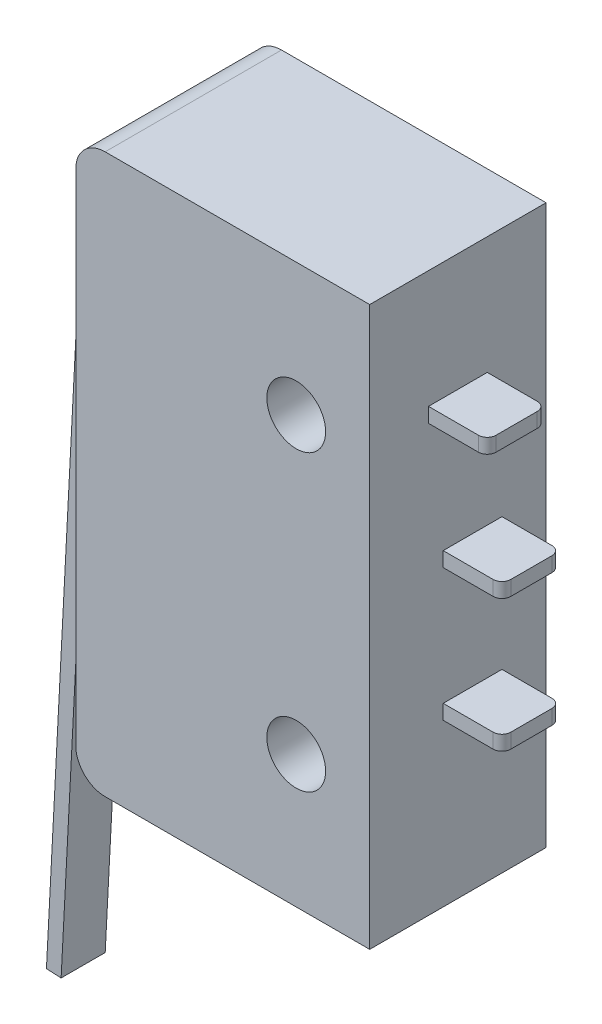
ISO-10303-21;
HEADER;
FILE_DESCRIPTION(('STEP AP214'),'2;1');
FILE_NAME('part.step','',(''),(''),'','','');
FILE_SCHEMA(('AUTOMOTIVE_DESIGN { 1 0 10303 214 1 1 1 1 }'));
ENDSEC;
DATA;
#1=APPLICATION_CONTEXT('core data for automotive mechanical design processes');
#2=APPLICATION_PROTOCOL_DEFINITION('international standard','automotive_design',2000,#1);
#3=PRODUCT_CONTEXT('',#1,'mechanical');
#4=PRODUCT('Part','Part','',(#3));
#5=PRODUCT_RELATED_PRODUCT_CATEGORY('part','',(#4));
#6=PRODUCT_DEFINITION_FORMATION('','',#4);
#7=PRODUCT_DEFINITION_CONTEXT('part definition',#1,'design');
#8=PRODUCT_DEFINITION('design','',#6,#7);
#9=PRODUCT_DEFINITION_SHAPE('','',#8);
#10=(LENGTH_UNIT() NAMED_UNIT(*) SI_UNIT(.MILLI.,.METRE.));
#11=(NAMED_UNIT(*) PLANE_ANGLE_UNIT() SI_UNIT($,.RADIAN.));
#12=(NAMED_UNIT(*) SI_UNIT($,.STERADIAN.) SOLID_ANGLE_UNIT());
#13=UNCERTAINTY_MEASURE_WITH_UNIT(LENGTH_MEASURE(1.E-05),#10,'distance_accuracy_value','');
#14=(GEOMETRIC_REPRESENTATION_CONTEXT(3) GLOBAL_UNCERTAINTY_ASSIGNED_CONTEXT((#13)) GLOBAL_UNIT_ASSIGNED_CONTEXT((#10,
#11,#12)) REPRESENTATION_CONTEXT('',''));
#15=CARTESIAN_POINT('',(0.,0.,0.));
#16=DIRECTION('',(0.,0.,1.));
#17=DIRECTION('',(1.,0.,0.));
#18=AXIS2_PLACEMENT_3D('',#15,#16,#17);
#19=CARTESIAN_POINT('',(-1.93975554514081,16.6495326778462,2.25));
#20=DIRECTION('',(-0.998629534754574,0.0523359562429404,0.));
#21=DIRECTION('',(0.,0.,1.));
#22=AXIS2_PLACEMENT_3D('',#19,#20,#21);
#23=PLANE('',#22);
#24=DIRECTION('',(0.0523359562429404,0.998629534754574,0.));
#25=VECTOR('',#24,1.);
#26=CARTESIAN_POINT('',(-1.93975554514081,16.6495326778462,3.75));
#27=LINE('',#26,#25);
#28=CARTESIAN_POINT('',(-3.24815445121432,-8.3162056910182,3.74999999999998));
#29=VERTEX_POINT('',#28);
#30=CARTESIAN_POINT('',(-2.06141570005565,14.3281186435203,3.75));
#31=VERTEX_POINT('',#30);
#32=EDGE_CURVE('E46',#29,#31,#27,.T.);
#33=ORIENTED_EDGE('',*,*,#32,.T.);
#34=DIRECTION('',(0.,0.,-1.));
#35=VECTOR('',#34,1.);
#36=CARTESIAN_POINT('',(-2.06141569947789,14.32811864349,2.25));
#37=LINE('',#36,#35);
#38=CARTESIAN_POINT('',(-2.06141569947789,14.32811864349,2.25));
#39=VERTEX_POINT('',#38);
#40=EDGE_CURVE('E119',#31,#39,#37,.T.);
#41=ORIENTED_EDGE('',*,*,#40,.T.);
#42=DIRECTION('',(-0.0523359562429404,-0.998629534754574,0.));
#43=VECTOR('',#42,1.);
#44=CARTESIAN_POINT('',(-1.93975554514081,16.6495326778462,2.25));
#45=LINE('',#44,#43);
#46=CARTESIAN_POINT('',(-3.24815445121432,-8.3162056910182,2.24999999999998));
#47=VERTEX_POINT('',#46);
#48=EDGE_CURVE('E138',#39,#47,#45,.T.);
#49=ORIENTED_EDGE('',*,*,#48,.T.);
#50=DIRECTION('',(0.,0.,1.));
#51=VECTOR('',#50,1.);
#52=CARTESIAN_POINT('',(-3.24815445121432,-8.3162056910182,3.74999999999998));
#53=LINE('',#52,#51);
#54=EDGE_CURVE('E66',#47,#29,#53,.T.);
#55=ORIENTED_EDGE('',*,*,#54,.T.);
#56=EDGE_LOOP('',(#33,#41,#49,#55));
#57=FACE_BOUND('',#56,.T.);
#58=ADVANCED_FACE('F42',(#57),#23,.T.);
#59=CARTESIAN_POINT('',(-1.93975554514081,16.6495326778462,2.25));
#60=DIRECTION('',(0.,0.,1.));
#61=DIRECTION('',(0.0523359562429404,0.998629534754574,0.));
#62=AXIS2_PLACEMENT_3D('',#59,#60,#61);
#63=PLANE('',#62);
#64=DIRECTION('',(-0.998629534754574,0.0523359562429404,0.));
#65=VECTOR('',#64,1.);
#66=CARTESIAN_POINT('',(-2.06141569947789,14.32811864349,2.25));
#67=LINE('',#66,#65);
#68=CARTESIAN_POINT('',(-1.56210093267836,14.3019506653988,2.25));
#69=VERTEX_POINT('',#68);
#70=EDGE_CURVE('E13',#69,#39,#67,.T.);
#71=ORIENTED_EDGE('',*,*,#70,.F.);
#72=DIRECTION('',(-0.0523359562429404,-0.998629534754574,0.));
#73=VECTOR('',#72,1.);
#74=CARTESIAN_POINT('',(-1.44044077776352,16.6233646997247,2.25));
#75=LINE('',#74,#73);
#76=CARTESIAN_POINT('',(-2.74883968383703,-8.34237366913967,2.24999999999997));
#77=VERTEX_POINT('',#76);
#78=EDGE_CURVE('E143',#69,#77,#75,.T.);
#79=ORIENTED_EDGE('',*,*,#78,.T.);
#80=DIRECTION('',(0.998629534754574,-0.0523359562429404,0.));
#81=VECTOR('',#80,1.);
#82=CARTESIAN_POINT('',(-3.24815445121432,-8.3162056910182,2.24999999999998));
#83=LINE('',#82,#81);
#84=EDGE_CURVE('E157',#47,#77,#83,.T.);
#85=ORIENTED_EDGE('',*,*,#84,.F.);
#86=ORIENTED_EDGE('',*,*,#48,.F.);
#87=EDGE_LOOP('',(#71,#79,#85,#86));
#88=FACE_BOUND('',#87,.T.);
#89=ADVANCED_FACE('F44',(#88),#63,.F.);
#90=CARTESIAN_POINT('',(-3.24815445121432,-8.3162056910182,3.74999999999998));
#91=DIRECTION('',(0.0523359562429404,0.998629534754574,0.));
#92=DIRECTION('',(0.,0.,-1.));
#93=AXIS2_PLACEMENT_3D('',#90,#91,#92);
#94=PLANE('',#93);
#95=DIRECTION('',(0.,0.,1.));
#96=VECTOR('',#95,1.);
#97=CARTESIAN_POINT('',(-2.74883968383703,-8.34237366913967,3.74999999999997));
#98=LINE('',#97,#96);
#99=CARTESIAN_POINT('',(-2.74883968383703,-8.34237366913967,3.74999999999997));
#100=VERTEX_POINT('',#99);
#101=EDGE_CURVE('E139',#77,#100,#98,.T.);
#102=ORIENTED_EDGE('',*,*,#101,.T.);
#103=DIRECTION('',(0.998629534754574,-0.0523359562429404,0.));
#104=VECTOR('',#103,1.);
#105=CARTESIAN_POINT('',(-3.24815445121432,-8.3162056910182,3.74999999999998));
#106=LINE('',#105,#104);
#107=EDGE_CURVE('E135',#29,#100,#106,.T.);
#108=ORIENTED_EDGE('',*,*,#107,.F.);
#109=ORIENTED_EDGE('',*,*,#54,.F.);
#110=ORIENTED_EDGE('',*,*,#84,.T.);
#111=EDGE_LOOP('',(#102,#108,#109,#110));
#112=FACE_BOUND('',#111,.T.);
#113=ADVANCED_FACE('F161',(#112),#94,.F.);
#114=CARTESIAN_POINT('',(-1.93975554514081,16.6495326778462,3.75));
#115=DIRECTION('',(0.,0.,-1.));
#116=DIRECTION('',(-0.0523359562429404,-0.998629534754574,0.));
#117=AXIS2_PLACEMENT_3D('',#114,#115,#116);
#118=PLANE('',#117);
#119=DIRECTION('',(0.998629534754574,-0.0523359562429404,0.));
#120=VECTOR('',#119,1.);
#121=CARTESIAN_POINT('',(-2.06141569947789,14.32811864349,3.75));
#122=LINE('',#121,#120);
#123=CARTESIAN_POINT('',(-1.56210093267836,14.3019506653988,3.75));
#124=VERTEX_POINT('',#123);
#125=EDGE_CURVE('E109',#31,#124,#122,.T.);
#126=ORIENTED_EDGE('',*,*,#125,.F.);
#127=ORIENTED_EDGE('',*,*,#32,.F.);
#128=ORIENTED_EDGE('',*,*,#107,.T.);
#129=DIRECTION('',(0.0523359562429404,0.998629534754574,0.));
#130=VECTOR('',#129,1.);
#131=CARTESIAN_POINT('',(-1.44044077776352,16.6233646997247,3.75));
#132=LINE('',#131,#130);
#133=EDGE_CURVE('E133',#100,#124,#132,.T.);
#134=ORIENTED_EDGE('',*,*,#133,.T.);
#135=EDGE_LOOP('',(#126,#127,#128,#134));
#136=FACE_BOUND('',#135,.T.);
#137=ADVANCED_FACE('F134',(#136),#118,.F.);
#138=CARTESIAN_POINT('',(-1.44044077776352,16.6233646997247,2.25));
#139=DIRECTION('',(-0.998629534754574,0.0523359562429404,0.));
#140=DIRECTION('',(0.,0.,1.));
#141=AXIS2_PLACEMENT_3D('',#138,#139,#140);
#142=PLANE('',#141);
#143=DIRECTION('',(0.,0.,-1.));
#144=VECTOR('',#143,1.);
#145=CARTESIAN_POINT('',(-1.5621009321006,14.3019506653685,2.25));
#146=LINE('',#145,#144);
#147=EDGE_CURVE('E51',#124,#69,#146,.T.);
#148=ORIENTED_EDGE('',*,*,#147,.F.);
#149=ORIENTED_EDGE('',*,*,#133,.F.);
#150=ORIENTED_EDGE('',*,*,#101,.F.);
#151=ORIENTED_EDGE('',*,*,#78,.F.);
#152=EDGE_LOOP('',(#148,#149,#150,#151));
#153=FACE_BOUND('',#152,.T.);
#154=ADVANCED_FACE('F142',(#153),#142,.F.);
#155=CARTESIAN_POINT('',(0.,15.5,3.75));
#156=DIRECTION('',(-1.,0.,0.));
#157=DIRECTION('',(0.,0.,1.));
#158=AXIS2_PLACEMENT_3D('',#155,#156,#157);
#159=PLANE('',#158);
#160=DIRECTION('',(0.,0.,-1.));
#161=VECTOR('',#160,1.);
#162=CARTESIAN_POINT('',(0.,15.,3.75));
#163=LINE('',#162,#161);
#164=CARTESIAN_POINT('',(0.,15.,3.75));
#165=VERTEX_POINT('',#164);
#166=CARTESIAN_POINT('',(0.,15.,2.25));
#167=VERTEX_POINT('',#166);
#168=EDGE_CURVE('E233',#165,#167,#163,.T.);
#169=ORIENTED_EDGE('',*,*,#168,.T.);
#170=DIRECTION('',(0.,-1.,0.));
#171=VECTOR('',#170,1.);
#172=CARTESIAN_POINT('',(0.,15.5,2.25));
#173=LINE('',#172,#171);
#174=CARTESIAN_POINT('',(0.,15.5,2.25));
#175=VERTEX_POINT('',#174);
#176=EDGE_CURVE('E148',#175,#167,#173,.T.);
#177=ORIENTED_EDGE('',*,*,#176,.F.);
#178=DIRECTION('',(0.,0.,-1.));
#179=VECTOR('',#178,1.);
#180=CARTESIAN_POINT('',(0.,15.5,3.75));
#181=LINE('',#180,#179);
#182=CARTESIAN_POINT('',(0.,15.5,3.75));
#183=VERTEX_POINT('',#182);
#184=EDGE_CURVE('E225',#183,#175,#181,.T.);
#185=ORIENTED_EDGE('',*,*,#184,.F.);
#186=DIRECTION('',(0.,-1.,0.));
#187=VECTOR('',#186,1.);
#188=CARTESIAN_POINT('',(0.,15.5,3.75));
#189=LINE('',#188,#187);
#190=EDGE_CURVE('E230',#183,#165,#189,.T.);
#191=ORIENTED_EDGE('',*,*,#190,.T.);
#192=EDGE_LOOP('',(#169,#177,#185,#191));
#193=FACE_BOUND('',#192,.T.);
#194=ADVANCED_FACE('F175',(#193),#159,.F.);
#195=CARTESIAN_POINT('',(0.,15.5,2.25));
#196=DIRECTION('',(0.,1.,0.));
#197=DIRECTION('',(0.,0.,1.));
#198=AXIS2_PLACEMENT_3D('',#195,#196,#197);
#199=PLANE('',#198);
#200=DIRECTION('',(0.,0.,-1.));
#201=VECTOR('',#200,1.);
#202=CARTESIAN_POINT('',(-0.826510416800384,15.5,2.25));
#203=LINE('',#202,#201);
#204=CARTESIAN_POINT('',(-0.826510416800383,15.5000000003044,3.75));
#205=VERTEX_POINT('',#204);
#206=CARTESIAN_POINT('',(-0.826510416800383,15.5000000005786,2.25));
#207=VERTEX_POINT('',#206);
#208=EDGE_CURVE('E234',#205,#207,#203,.T.);
#209=ORIENTED_EDGE('',*,*,#208,.F.);
#210=DIRECTION('',(1.,0.,0.));
#211=VECTOR('',#210,1.);
#212=CARTESIAN_POINT('',(0.,15.5,3.75));
#213=LINE('',#212,#211);
#214=EDGE_CURVE('E228',#205,#183,#213,.T.);
#215=ORIENTED_EDGE('',*,*,#214,.T.);
#216=ORIENTED_EDGE('',*,*,#184,.T.);
#217=DIRECTION('',(-1.,0.,0.));
#218=VECTOR('',#217,1.);
#219=CARTESIAN_POINT('',(0.,15.5,2.25));
#220=LINE('',#219,#218);
#221=EDGE_CURVE('E222',#175,#207,#220,.T.);
#222=ORIENTED_EDGE('',*,*,#221,.T.);
#223=EDGE_LOOP('',(#209,#215,#216,#222));
#224=FACE_BOUND('',#223,.T.);
#225=ADVANCED_FACE('F179',(#224),#199,.T.);
#226=CARTESIAN_POINT('',(0.,15.5,3.75));
#227=DIRECTION('',(0.,0.,-1.));
#228=DIRECTION('',(-1.,0.,0.));
#229=AXIS2_PLACEMENT_3D('',#226,#227,#228);
#230=PLANE('',#229);
#231=ORIENTED_EDGE('',*,*,#214,.F.);
#232=DIRECTION('',(0.,-1.,0.));
#233=VECTOR('',#232,1.);
#234=CARTESIAN_POINT('',(-0.826510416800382,15.5,3.75));
#235=LINE('',#234,#233);
#236=CARTESIAN_POINT('',(-0.826510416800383,15.,3.75));
#237=VERTEX_POINT('',#236);
#238=EDGE_CURVE('E217',#205,#237,#235,.T.);
#239=ORIENTED_EDGE('',*,*,#238,.T.);
#240=DIRECTION('',(1.,0.,0.));
#241=VECTOR('',#240,1.);
#242=CARTESIAN_POINT('',(0.,15.,3.75));
#243=LINE('',#242,#241);
#244=EDGE_CURVE('E214',#237,#165,#243,.T.);
#245=ORIENTED_EDGE('',*,*,#244,.T.);
#246=ORIENTED_EDGE('',*,*,#190,.F.);
#247=EDGE_LOOP('',(#231,#239,#245,#246));
#248=FACE_BOUND('',#247,.T.);
#249=ADVANCED_FACE('F185',(#248),#230,.F.);
#250=CARTESIAN_POINT('',(0.,15.,2.25));
#251=DIRECTION('',(0.,1.,0.));
#252=DIRECTION('',(0.,0.,1.));
#253=AXIS2_PLACEMENT_3D('',#250,#251,#252);
#254=PLANE('',#253);
#255=ORIENTED_EDGE('',*,*,#244,.F.);
#256=DIRECTION('',(0.,0.,-1.));
#257=VECTOR('',#256,1.);
#258=CARTESIAN_POINT('',(-0.826510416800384,15.,2.25));
#259=LINE('',#258,#257);
#260=CARTESIAN_POINT('',(-0.826510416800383,15.0000000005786,2.25));
#261=VERTEX_POINT('',#260);
#262=EDGE_CURVE('E127',#237,#261,#259,.T.);
#263=ORIENTED_EDGE('',*,*,#262,.T.);
#264=DIRECTION('',(-1.,0.,0.));
#265=VECTOR('',#264,1.);
#266=CARTESIAN_POINT('',(0.,15.,2.25));
#267=LINE('',#266,#265);
#268=EDGE_CURVE('E209',#167,#261,#267,.T.);
#269=ORIENTED_EDGE('',*,*,#268,.F.);
#270=ORIENTED_EDGE('',*,*,#168,.F.);
#271=EDGE_LOOP('',(#255,#263,#269,#270));
#272=FACE_BOUND('',#271,.T.);
#273=ADVANCED_FACE('F195',(#272),#254,.F.);
#274=CARTESIAN_POINT('',(0.,15.5,2.25));
#275=DIRECTION('',(0.,0.,1.));
#276=DIRECTION('',(1.,0.,0.));
#277=AXIS2_PLACEMENT_3D('',#274,#275,#276);
#278=PLANE('',#277);
#279=ORIENTED_EDGE('',*,*,#268,.T.);
#280=DIRECTION('',(0.,1.,0.));
#281=VECTOR('',#280,1.);
#282=CARTESIAN_POINT('',(-0.826510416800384,15.5,2.25));
#283=LINE('',#282,#281);
#284=EDGE_CURVE('E210',#261,#207,#283,.T.);
#285=ORIENTED_EDGE('',*,*,#284,.T.);
#286=ORIENTED_EDGE('',*,*,#221,.F.);
#287=ORIENTED_EDGE('',*,*,#176,.T.);
#288=EDGE_LOOP('',(#279,#285,#286,#287));
#289=FACE_BOUND('',#288,.T.);
#290=ADVANCED_FACE('F198',(#289),#278,.F.);
#291=CARTESIAN_POINT('',(-0.826510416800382,14.2633999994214,3.75));
#292=DIRECTION('',(0.,0.,1.));
#293=DIRECTION('',(1.,0.,0.));
#294=AXIS2_PLACEMENT_3D('',#291,#292,#293);
#295=PLANE('',#294);
#296=ORIENTED_EDGE('',*,*,#125,.T.);
#297=CARTESIAN_POINT('',(-0.826510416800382,14.2634,3.75));
#298=DIRECTION('',(0.,0.,1.));
#299=DIRECTION('',(1.,0.,0.));
#300=AXIS2_PLACEMENT_3D('',#297,#298,#299);
#301=CIRCLE('',#300,0.736600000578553);
#302=EDGE_CURVE('E112',#124,#237,#301,.F.);
#303=ORIENTED_EDGE('',*,*,#302,.T.);
#304=ORIENTED_EDGE('',*,*,#238,.F.);
#305=CARTESIAN_POINT('',(-0.826510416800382,14.2633999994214,3.75));
#306=DIRECTION('',(0.,0.,-1.));
#307=DIRECTION('',(-1.,0.,0.));
#308=AXIS2_PLACEMENT_3D('',#305,#306,#307);
#309=CIRCLE('',#308,1.23660000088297);
#310=EDGE_CURVE('E115',#31,#205,#309,.T.);
#311=ORIENTED_EDGE('',*,*,#310,.F.);
#312=EDGE_LOOP('',(#296,#303,#304,#311));
#313=FACE_BOUND('',#312,.T.);
#314=ADVANCED_FACE('F111',(#313),#295,.T.);
#315=CARTESIAN_POINT('',(-0.826510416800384,14.2633999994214,2.25));
#316=DIRECTION('',(0.,0.,-1.));
#317=DIRECTION('',(-1.,0.,0.));
#318=AXIS2_PLACEMENT_3D('',#315,#316,#317);
#319=PLANE('',#318);
#320=CARTESIAN_POINT('',(-0.826510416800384,14.2634,2.25));
#321=DIRECTION('',(0.,0.,1.));
#322=DIRECTION('',(1.,0.,0.));
#323=AXIS2_PLACEMENT_3D('',#320,#321,#322);
#324=CIRCLE('',#323,0.736600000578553);
#325=EDGE_CURVE('E129',#261,#69,#324,.T.);
#326=ORIENTED_EDGE('',*,*,#325,.T.);
#327=ORIENTED_EDGE('',*,*,#70,.T.);
#328=CARTESIAN_POINT('',(-0.826510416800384,14.2633999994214,2.25));
#329=DIRECTION('',(0.,0.,1.));
#330=DIRECTION('',(1.,0.,0.));
#331=AXIS2_PLACEMENT_3D('',#328,#329,#330);
#332=CIRCLE('',#331,1.23660000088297);
#333=EDGE_CURVE('E59',#207,#39,#332,.T.);
#334=ORIENTED_EDGE('',*,*,#333,.F.);
#335=ORIENTED_EDGE('',*,*,#284,.F.);
#336=EDGE_LOOP('',(#326,#327,#334,#335));
#337=FACE_BOUND('',#336,.T.);
#338=ADVANCED_FACE('F190',(#337),#319,.T.);
#339=CARTESIAN_POINT('',(-0.826510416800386,14.2634,0.82186505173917));
#340=DIRECTION('',(0.,0.,1.));
#341=DIRECTION('',(1.,0.,0.));
#342=AXIS2_PLACEMENT_3D('',#339,#340,#341);
#343=CYLINDRICAL_SURFACE('',#342,1.23660000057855);
#344=ORIENTED_EDGE('',*,*,#208,.T.);
#345=ORIENTED_EDGE('',*,*,#333,.T.);
#346=ORIENTED_EDGE('',*,*,#40,.F.);
#347=ORIENTED_EDGE('',*,*,#310,.T.);
#348=EDGE_LOOP('',(#344,#345,#346,#347));
#349=FACE_BOUND('',#348,.T.);
#350=ADVANCED_FACE('F205',(#349),#343,.T.);
#351=CARTESIAN_POINT('',(-0.826510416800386,14.2634,0.82186505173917));
#352=DIRECTION('',(0.,0.,1.));
#353=DIRECTION('',(1.,0.,0.));
#354=AXIS2_PLACEMENT_3D('',#351,#352,#353);
#355=CYLINDRICAL_SURFACE('',#354,0.736600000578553);
#356=ORIENTED_EDGE('',*,*,#262,.F.);
#357=ORIENTED_EDGE('',*,*,#302,.F.);
#358=ORIENTED_EDGE('',*,*,#147,.T.);
#359=ORIENTED_EDGE('',*,*,#325,.F.);
#360=EDGE_LOOP('',(#356,#357,#358,#359));
#361=FACE_BOUND('',#360,.T.);
#362=ADVANCED_FACE('F122',(#361),#355,.F.);
#363=CLOSED_SHELL('',(#58,#89,#113,#137,#154,#194,#225,#249,#273,#290,#314,#338,#350,#362));
#364=MANIFOLD_SOLID_BREP('B2',#363);
#365=CARTESIAN_POINT('',(10.,0.,6.));
#366=DIRECTION('',(-1.,0.,0.));
#367=DIRECTION('',(0.,-1.,0.));
#368=AXIS2_PLACEMENT_3D('',#365,#366,#367);
#369=PLANE('',#368);
#370=DIRECTION('',(0.,-1.,0.));
#371=VECTOR('',#370,1.);
#372=CARTESIAN_POINT('',(10.,10.5,3.5));
#373=LINE('',#372,#371);
#374=CARTESIAN_POINT('',(10.,10.5,3.5));
#375=VERTEX_POINT('',#374);
#376=CARTESIAN_POINT('',(10.,10.,3.5));
#377=VERTEX_POINT('',#376);
#378=EDGE_CURVE('E526',#375,#377,#373,.T.);
#379=ORIENTED_EDGE('',*,*,#378,.F.);
#380=DIRECTION('',(0.,0.,1.));
#381=VECTOR('',#380,1.);
#382=CARTESIAN_POINT('',(10.,10.5,3.5));
#383=LINE('',#382,#381);
#384=CARTESIAN_POINT('',(10.,10.5,1.5));
#385=VERTEX_POINT('',#384);
#386=EDGE_CURVE('E535',#385,#375,#383,.T.);
#387=ORIENTED_EDGE('',*,*,#386,.F.);
#388=DIRECTION('',(0.,1.,0.));
#389=VECTOR('',#388,1.);
#390=CARTESIAN_POINT('',(10.,10.5,1.5));
#391=LINE('',#390,#389);
#392=CARTESIAN_POINT('',(10.,10.,1.5));
#393=VERTEX_POINT('',#392);
#394=EDGE_CURVE('E532',#393,#385,#391,.T.);
#395=ORIENTED_EDGE('',*,*,#394,.F.);
#396=DIRECTION('',(0.,0.,-1.));
#397=VECTOR('',#396,1.);
#398=CARTESIAN_POINT('',(10.,10.,3.5));
#399=LINE('',#398,#397);
#400=EDGE_CURVE('E529',#377,#393,#399,.T.);
#401=ORIENTED_EDGE('',*,*,#400,.F.);
#402=EDGE_LOOP('',(#379,#387,#395,#401));
#403=FACE_BOUND('',#402,.T.);
#404=DIRECTION('',(0.,1.,0.));
#405=VECTOR('',#404,1.);
#406=CARTESIAN_POINT('',(10.,0.,0.));
#407=LINE('',#406,#405);
#408=CARTESIAN_POINT('',(10.,0.,0.));
#409=VERTEX_POINT('',#408);
#410=CARTESIAN_POINT('',(10.,19.,0.));
#411=VERTEX_POINT('',#410);
#412=EDGE_CURVE('E595',#409,#411,#407,.T.);
#413=ORIENTED_EDGE('',*,*,#412,.T.);
#414=DIRECTION('',(0.,0.,-1.));
#415=VECTOR('',#414,1.);
#416=CARTESIAN_POINT('',(10.,19.,6.));
#417=LINE('',#416,#415);
#418=CARTESIAN_POINT('',(10.,19.,6.));
#419=VERTEX_POINT('',#418);
#420=EDGE_CURVE('E610',#419,#411,#417,.T.);
#421=ORIENTED_EDGE('',*,*,#420,.F.);
#422=DIRECTION('',(0.,1.,0.));
#423=VECTOR('',#422,1.);
#424=CARTESIAN_POINT('',(10.,0.,6.));
#425=LINE('',#424,#423);
#426=CARTESIAN_POINT('',(10.,0.,6.));
#427=VERTEX_POINT('',#426);
#428=EDGE_CURVE('E605',#427,#419,#425,.T.);
#429=ORIENTED_EDGE('',*,*,#428,.F.);
#430=DIRECTION('',(0.,0.,-1.));
#431=VECTOR('',#430,1.);
#432=CARTESIAN_POINT('',(10.,0.,6.));
#433=LINE('',#432,#431);
#434=EDGE_CURVE('E613',#427,#409,#433,.T.);
#435=ORIENTED_EDGE('',*,*,#434,.T.);
#436=EDGE_LOOP('',(#413,#421,#429,#435));
#437=FACE_BOUND('',#436,.T.);
#438=DIRECTION('',(0.,-1.,0.));
#439=VECTOR('',#438,1.);
#440=CARTESIAN_POINT('',(10.,15.,4.));
#441=LINE('',#440,#439);
#442=CARTESIAN_POINT('',(10.,15.,4.));
#443=VERTEX_POINT('',#442);
#444=CARTESIAN_POINT('',(10.,14.5,4.));
#445=VERTEX_POINT('',#444);
#446=EDGE_CURVE('E552',#443,#445,#441,.T.);
#447=ORIENTED_EDGE('',*,*,#446,.F.);
#448=DIRECTION('',(0.,0.,1.));
#449=VECTOR('',#448,1.);
#450=CARTESIAN_POINT('',(10.,15.,4.));
#451=LINE('',#450,#449);
#452=CARTESIAN_POINT('',(10.,15.,2.));
#453=VERTEX_POINT('',#452);
#454=EDGE_CURVE('E561',#453,#443,#451,.T.);
#455=ORIENTED_EDGE('',*,*,#454,.F.);
#456=DIRECTION('',(0.,1.,0.));
#457=VECTOR('',#456,1.);
#458=CARTESIAN_POINT('',(10.,15.,2.));
#459=LINE('',#458,#457);
#460=CARTESIAN_POINT('',(10.,14.5,2.));
#461=VERTEX_POINT('',#460);
#462=EDGE_CURVE('E558',#461,#453,#459,.T.);
#463=ORIENTED_EDGE('',*,*,#462,.F.);
#464=DIRECTION('',(0.,0.,-1.));
#465=VECTOR('',#464,1.);
#466=CARTESIAN_POINT('',(10.,14.5,4.));
#467=LINE('',#466,#465);
#468=EDGE_CURVE('E555',#445,#461,#467,.T.);
#469=ORIENTED_EDGE('',*,*,#468,.F.);
#470=EDGE_LOOP('',(#447,#455,#463,#469));
#471=FACE_BOUND('',#470,.T.);
#472=DIRECTION('',(0.,-1.,0.));
#473=VECTOR('',#472,1.);
#474=CARTESIAN_POINT('',(10.,6.,3.5));
#475=LINE('',#474,#473);
#476=CARTESIAN_POINT('',(10.,6.,3.5));
#477=VERTEX_POINT('',#476);
#478=CARTESIAN_POINT('',(10.,5.5,3.5));
#479=VERTEX_POINT('',#478);
#480=EDGE_CURVE('E490',#477,#479,#475,.T.);
#481=ORIENTED_EDGE('',*,*,#480,.F.);
#482=DIRECTION('',(0.,0.,1.));
#483=VECTOR('',#482,1.);
#484=CARTESIAN_POINT('',(10.,6.,3.5));
#485=LINE('',#484,#483);
#486=CARTESIAN_POINT('',(10.,6.,1.5));
#487=VERTEX_POINT('',#486);
#488=EDGE_CURVE('E503',#487,#477,#485,.T.);
#489=ORIENTED_EDGE('',*,*,#488,.F.);
#490=DIRECTION('',(0.,1.,0.));
#491=VECTOR('',#490,1.);
#492=CARTESIAN_POINT('',(10.,6.,1.5));
#493=LINE('',#492,#491);
#494=CARTESIAN_POINT('',(10.,5.5,1.5));
#495=VERTEX_POINT('',#494);
#496=EDGE_CURVE('E512',#495,#487,#493,.T.);
#497=ORIENTED_EDGE('',*,*,#496,.F.);
#498=DIRECTION('',(0.,0.,-1.));
#499=VECTOR('',#498,1.);
#500=CARTESIAN_POINT('',(10.,5.5,3.5));
#501=LINE('',#500,#499);
#502=EDGE_CURVE('E506',#479,#495,#501,.T.);
#503=ORIENTED_EDGE('',*,*,#502,.F.);
#504=EDGE_LOOP('',(#481,#489,#497,#503));
#505=FACE_BOUND('',#504,.T.);
#506=ADVANCED_FACE('F325',(#403,#437,#471,#505),#369,.F.);
#507=CARTESIAN_POINT('',(0.,0.,6.));
#508=DIRECTION('',(1.,0.,0.));
#509=DIRECTION('',(0.,0.,-1.));
#510=AXIS2_PLACEMENT_3D('',#507,#508,#509);
#511=PLANE('',#510);
#512=DIRECTION('',(0.,-1.,0.));
#513=VECTOR('',#512,1.);
#514=CARTESIAN_POINT('',(0.,0.,0.));
#515=LINE('',#514,#513);
#516=CARTESIAN_POINT('',(0.,18.,0.));
#517=VERTEX_POINT('',#516);
#518=CARTESIAN_POINT('',(0.,1.,0.));
#519=VERTEX_POINT('',#518);
#520=EDGE_CURVE('E590',#517,#519,#515,.T.);
#521=ORIENTED_EDGE('',*,*,#520,.T.);
#522=DIRECTION('',(0.,0.,-1.));
#523=VECTOR('',#522,1.);
#524=CARTESIAN_POINT('',(0.,1.,6.));
#525=LINE('',#524,#523);
#526=CARTESIAN_POINT('',(0.,1.,6.));
#527=VERTEX_POINT('',#526);
#528=EDGE_CURVE('E626',#519,#527,#525,.F.);
#529=ORIENTED_EDGE('',*,*,#528,.T.);
#530=DIRECTION('',(0.,-1.,0.));
#531=VECTOR('',#530,1.);
#532=CARTESIAN_POINT('',(0.,0.,6.));
#533=LINE('',#532,#531);
#534=CARTESIAN_POINT('',(0.,18.,6.));
#535=VERTEX_POINT('',#534);
#536=EDGE_CURVE('E600',#535,#527,#533,.T.);
#537=ORIENTED_EDGE('',*,*,#536,.F.);
#538=DIRECTION('',(0.,0.,-1.));
#539=VECTOR('',#538,1.);
#540=CARTESIAN_POINT('',(0.,18.,6.));
#541=LINE('',#540,#539);
#542=EDGE_CURVE('E623',#535,#517,#541,.T.);
#543=ORIENTED_EDGE('',*,*,#542,.T.);
#544=EDGE_LOOP('',(#521,#529,#537,#543));
#545=FACE_BOUND('',#544,.T.);
#546=ADVANCED_FACE('F327',(#545),#511,.F.);
#547=CARTESIAN_POINT('',(0.,0.,6.));
#548=DIRECTION('',(0.,1.,0.));
#549=DIRECTION('',(0.,0.,1.));
#550=AXIS2_PLACEMENT_3D('',#547,#548,#549);
#551=PLANE('',#550);
#552=DIRECTION('',(1.,0.,0.));
#553=VECTOR('',#552,1.);
#554=CARTESIAN_POINT('',(0.,0.,6.));
#555=LINE('',#554,#553);
#556=CARTESIAN_POINT('',(1.,0.,6.));
#557=VERTEX_POINT('',#556);
#558=EDGE_CURVE('E603',#557,#427,#555,.T.);
#559=ORIENTED_EDGE('',*,*,#558,.F.);
#560=DIRECTION('',(0.,0.,-1.));
#561=VECTOR('',#560,1.);
#562=CARTESIAN_POINT('',(1.,0.,6.));
#563=LINE('',#562,#561);
#564=CARTESIAN_POINT('',(1.,0.,0.));
#565=VERTEX_POINT('',#564);
#566=EDGE_CURVE('E616',#557,#565,#563,.T.);
#567=ORIENTED_EDGE('',*,*,#566,.T.);
#568=DIRECTION('',(1.,0.,0.));
#569=VECTOR('',#568,1.);
#570=CARTESIAN_POINT('',(0.,0.,0.));
#571=LINE('',#570,#569);
#572=EDGE_CURVE('E593',#565,#409,#571,.T.);
#573=ORIENTED_EDGE('',*,*,#572,.T.);
#574=ORIENTED_EDGE('',*,*,#434,.F.);
#575=EDGE_LOOP('',(#559,#567,#573,#574));
#576=FACE_BOUND('',#575,.T.);
#577=ADVANCED_FACE('F719',(#576),#551,.F.);
#578=CARTESIAN_POINT('',(0.,19.,6.));
#579=DIRECTION('',(0.,-1.,0.));
#580=DIRECTION('',(0.,0.,-1.));
#581=AXIS2_PLACEMENT_3D('',#578,#579,#580);
#582=PLANE('',#581);
#583=DIRECTION('',(-1.,0.,0.));
#584=VECTOR('',#583,1.);
#585=CARTESIAN_POINT('',(0.,19.,0.));
#586=LINE('',#585,#584);
#587=CARTESIAN_POINT('',(1.,19.,0.));
#588=VERTEX_POINT('',#587);
#589=EDGE_CURVE('E597',#411,#588,#586,.T.);
#590=ORIENTED_EDGE('',*,*,#589,.T.);
#591=DIRECTION('',(0.,0.,-1.));
#592=VECTOR('',#591,1.);
#593=CARTESIAN_POINT('',(1.,19.,6.));
#594=LINE('',#593,#592);
#595=CARTESIAN_POINT('',(1.,19.,6.));
#596=VERTEX_POINT('',#595);
#597=EDGE_CURVE('E632',#588,#596,#594,.F.);
#598=ORIENTED_EDGE('',*,*,#597,.T.);
#599=DIRECTION('',(-1.,0.,0.));
#600=VECTOR('',#599,1.);
#601=CARTESIAN_POINT('',(0.,19.,6.));
#602=LINE('',#601,#600);
#603=EDGE_CURVE('E607',#419,#596,#602,.T.);
#604=ORIENTED_EDGE('',*,*,#603,.F.);
#605=ORIENTED_EDGE('',*,*,#420,.T.);
#606=EDGE_LOOP('',(#590,#598,#604,#605));
#607=FACE_BOUND('',#606,.T.);
#608=ADVANCED_FACE('F724',(#607),#582,.F.);
#609=CARTESIAN_POINT('',(0.,19.,6.));
#610=DIRECTION('',(0.,0.,-1.));
#611=DIRECTION('',(-1.,0.,0.));
#612=AXIS2_PLACEMENT_3D('',#609,#610,#611);
#613=PLANE('',#612);
#614=CARTESIAN_POINT('',(7.5,4.5,6.));
#615=DIRECTION('',(0.,0.,1.));
#616=DIRECTION('',(1.,0.,0.));
#617=AXIS2_PLACEMENT_3D('',#614,#615,#616);
#618=CIRCLE('',#617,1.);
#619=CARTESIAN_POINT('',(8.5,4.5,6.));
#620=VERTEX_POINT('',#619);
#621=EDGE_CURVE('E578',#620,#620,#618,.T.);
#622=ORIENTED_EDGE('',*,*,#621,.F.);
#623=EDGE_LOOP('',(#622));
#624=FACE_BOUND('',#623,.T.);
#625=CARTESIAN_POINT('',(7.5,14.5,6.));
#626=DIRECTION('',(0.,0.,1.));
#627=DIRECTION('',(1.,0.,0.));
#628=AXIS2_PLACEMENT_3D('',#625,#626,#627);
#629=CIRCLE('',#628,0.999999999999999);
#630=CARTESIAN_POINT('',(8.5,14.5,6.));
#631=VERTEX_POINT('',#630);
#632=EDGE_CURVE('E584',#631,#631,#629,.T.);
#633=ORIENTED_EDGE('',*,*,#632,.F.);
#634=EDGE_LOOP('',(#633));
#635=FACE_BOUND('',#634,.T.);
#636=ORIENTED_EDGE('',*,*,#536,.T.);
#637=CARTESIAN_POINT('',(1.,1.,6.));
#638=DIRECTION('',(0.,0.,-1.));
#639=DIRECTION('',(-1.,0.,0.));
#640=AXIS2_PLACEMENT_3D('',#637,#638,#639);
#641=CIRCLE('',#640,1.);
#642=EDGE_CURVE('E630',#527,#557,#641,.F.);
#643=ORIENTED_EDGE('',*,*,#642,.T.);
#644=ORIENTED_EDGE('',*,*,#558,.T.);
#645=ORIENTED_EDGE('',*,*,#428,.T.);
#646=ORIENTED_EDGE('',*,*,#603,.T.);
#647=CARTESIAN_POINT('',(1.,18.,6.));
#648=DIRECTION('',(0.,0.,-1.));
#649=DIRECTION('',(-1.,0.,0.));
#650=AXIS2_PLACEMENT_3D('',#647,#648,#649);
#651=CIRCLE('',#650,1.);
#652=EDGE_CURVE('E628',#596,#535,#651,.F.);
#653=ORIENTED_EDGE('',*,*,#652,.T.);
#654=EDGE_LOOP('',(#636,#643,#644,#645,#646,#653));
#655=FACE_BOUND('',#654,.T.);
#656=ADVANCED_FACE('F731',(#624,#635,#655),#613,.F.);
#657=CARTESIAN_POINT('',(0.,19.,0.));
#658=DIRECTION('',(0.,0.,-1.));
#659=DIRECTION('',(-1.,0.,0.));
#660=AXIS2_PLACEMENT_3D('',#657,#658,#659);
#661=PLANE('',#660);
#662=CARTESIAN_POINT('',(7.5,4.5,0.));
#663=DIRECTION('',(0.,0.,1.));
#664=DIRECTION('',(1.,0.,0.));
#665=AXIS2_PLACEMENT_3D('',#662,#663,#664);
#666=CIRCLE('',#665,1.);
#667=CARTESIAN_POINT('',(8.5,4.5,0.));
#668=VERTEX_POINT('',#667);
#669=EDGE_CURVE('E581',#668,#668,#666,.T.);
#670=ORIENTED_EDGE('',*,*,#669,.T.);
#671=EDGE_LOOP('',(#670));
#672=FACE_BOUND('',#671,.T.);
#673=CARTESIAN_POINT('',(7.5,14.5,0.));
#674=DIRECTION('',(0.,0.,1.));
#675=DIRECTION('',(1.,0.,0.));
#676=AXIS2_PLACEMENT_3D('',#673,#674,#675);
#677=CIRCLE('',#676,0.999999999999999);
#678=CARTESIAN_POINT('',(8.5,14.5,0.));
#679=VERTEX_POINT('',#678);
#680=EDGE_CURVE('E587',#679,#679,#677,.T.);
#681=ORIENTED_EDGE('',*,*,#680,.T.);
#682=EDGE_LOOP('',(#681));
#683=FACE_BOUND('',#682,.T.);
#684=ORIENTED_EDGE('',*,*,#572,.F.);
#685=CARTESIAN_POINT('',(1.,1.,0.));
#686=DIRECTION('',(0.,0.,-1.));
#687=DIRECTION('',(-1.,0.,0.));
#688=AXIS2_PLACEMENT_3D('',#685,#686,#687);
#689=CIRCLE('',#688,1.);
#690=EDGE_CURVE('E621',#565,#519,#689,.T.);
#691=ORIENTED_EDGE('',*,*,#690,.T.);
#692=ORIENTED_EDGE('',*,*,#520,.F.);
#693=CARTESIAN_POINT('',(1.,18.,0.));
#694=DIRECTION('',(0.,0.,-1.));
#695=DIRECTION('',(-1.,0.,0.));
#696=AXIS2_PLACEMENT_3D('',#693,#694,#695);
#697=CIRCLE('',#696,1.);
#698=EDGE_CURVE('E619',#517,#588,#697,.T.);
#699=ORIENTED_EDGE('',*,*,#698,.T.);
#700=ORIENTED_EDGE('',*,*,#589,.F.);
#701=ORIENTED_EDGE('',*,*,#412,.F.);
#702=EDGE_LOOP('',(#684,#691,#692,#699,#700,#701));
#703=FACE_BOUND('',#702,.T.);
#704=ADVANCED_FACE('F745',(#672,#683,#703),#661,.T.);
#705=CARTESIAN_POINT('',(1.,1.,6.));
#706=DIRECTION('',(0.,0.,-1.));
#707=DIRECTION('',(-1.,0.,0.));
#708=AXIS2_PLACEMENT_3D('',#705,#706,#707);
#709=CYLINDRICAL_SURFACE('',#708,1.);
#710=ORIENTED_EDGE('',*,*,#642,.F.);
#711=ORIENTED_EDGE('',*,*,#528,.F.);
#712=ORIENTED_EDGE('',*,*,#690,.F.);
#713=ORIENTED_EDGE('',*,*,#566,.F.);
#714=EDGE_LOOP('',(#710,#711,#712,#713));
#715=FACE_BOUND('',#714,.T.);
#716=ADVANCED_FACE('F741',(#715),#709,.T.);
#717=CARTESIAN_POINT('',(1.,18.,6.));
#718=DIRECTION('',(0.,0.,-1.));
#719=DIRECTION('',(-1.,0.,0.));
#720=AXIS2_PLACEMENT_3D('',#717,#718,#719);
#721=CYLINDRICAL_SURFACE('',#720,1.);
#722=ORIENTED_EDGE('',*,*,#652,.F.);
#723=ORIENTED_EDGE('',*,*,#597,.F.);
#724=ORIENTED_EDGE('',*,*,#698,.F.);
#725=ORIENTED_EDGE('',*,*,#542,.F.);
#726=EDGE_LOOP('',(#722,#723,#724,#725));
#727=FACE_BOUND('',#726,.T.);
#728=ADVANCED_FACE('F751',(#727),#721,.T.);
#729=CARTESIAN_POINT('',(7.5,14.5,0.));
#730=DIRECTION('',(0.,0.,1.));
#731=DIRECTION('',(1.,0.,0.));
#732=AXIS2_PLACEMENT_3D('',#729,#730,#731);
#733=CYLINDRICAL_SURFACE('',#732,0.999999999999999);
#734=ORIENTED_EDGE('',*,*,#680,.F.);
#735=EDGE_LOOP('',(#734));
#736=FACE_BOUND('',#735,.T.);
#737=ORIENTED_EDGE('',*,*,#632,.T.);
#738=EDGE_LOOP('',(#737));
#739=FACE_BOUND('',#738,.T.);
#740=ADVANCED_FACE('F770',(#736,#739),#733,.F.);
#741=CARTESIAN_POINT('',(7.5,4.5,0.));
#742=DIRECTION('',(0.,0.,1.));
#743=DIRECTION('',(1.,0.,0.));
#744=AXIS2_PLACEMENT_3D('',#741,#742,#743);
#745=CYLINDRICAL_SURFACE('',#744,1.);
#746=ORIENTED_EDGE('',*,*,#669,.F.);
#747=EDGE_LOOP('',(#746));
#748=FACE_BOUND('',#747,.T.);
#749=ORIENTED_EDGE('',*,*,#621,.T.);
#750=EDGE_LOOP('',(#749));
#751=FACE_BOUND('',#750,.T.);
#752=ADVANCED_FACE('F773',(#748,#751),#745,.F.);
#753=CARTESIAN_POINT('',(12.,15.,4.));
#754=DIRECTION('',(0.,0.,-1.));
#755=DIRECTION('',(-1.,0.,0.));
#756=AXIS2_PLACEMENT_3D('',#753,#754,#755);
#757=PLANE('',#756);
#758=DIRECTION('',(-1.,0.,0.));
#759=VECTOR('',#758,1.);
#760=CARTESIAN_POINT('',(12.,14.5,4.));
#761=LINE('',#760,#759);
#762=CARTESIAN_POINT('',(11.7,14.5,4.));
#763=VERTEX_POINT('',#762);
#764=EDGE_CURVE('E576',#763,#445,#761,.T.);
#765=ORIENTED_EDGE('',*,*,#764,.F.);
#766=DIRECTION('',(0.,-1.,0.));
#767=VECTOR('',#766,1.);
#768=CARTESIAN_POINT('',(11.7,15.,4.));
#769=LINE('',#768,#767);
#770=CARTESIAN_POINT('',(11.7,15.,4.));
#771=VERTEX_POINT('',#770);
#772=EDGE_CURVE('E40',#763,#771,#769,.F.);
#773=ORIENTED_EDGE('',*,*,#772,.T.);
#774=DIRECTION('',(-1.,0.,0.));
#775=VECTOR('',#774,1.);
#776=CARTESIAN_POINT('',(12.,15.,4.));
#777=LINE('',#776,#775);
#778=EDGE_CURVE('E570',#771,#443,#777,.T.);
#779=ORIENTED_EDGE('',*,*,#778,.T.);
#780=ORIENTED_EDGE('',*,*,#446,.T.);
#781=EDGE_LOOP('',(#765,#773,#779,#780));
#782=FACE_BOUND('',#781,.T.);
#783=ADVANCED_FACE('F699',(#782),#757,.F.);
#784=CARTESIAN_POINT('',(12.,14.5,4.));
#785=DIRECTION('',(0.,1.,0.));
#786=DIRECTION('',(-1.,0.,0.));
#787=AXIS2_PLACEMENT_3D('',#784,#785,#786);
#788=PLANE('',#787);
#789=DIRECTION('',(-1.,0.,0.));
#790=VECTOR('',#789,1.);
#791=CARTESIAN_POINT('',(12.,14.5,2.));
#792=LINE('',#791,#790);
#793=CARTESIAN_POINT('',(11.7,14.5,2.));
#794=VERTEX_POINT('',#793);
#795=EDGE_CURVE('E574',#794,#461,#792,.T.);
#796=ORIENTED_EDGE('',*,*,#795,.F.);
#797=CARTESIAN_POINT('',(11.7,14.5,2.3));
#798=DIRECTION('',(0.,1.,0.));
#799=DIRECTION('',(-1.,0.,0.));
#800=AXIS2_PLACEMENT_3D('',#797,#798,#799);
#801=CIRCLE('',#800,0.3);
#802=CARTESIAN_POINT('',(12.,14.5,2.3));
#803=VERTEX_POINT('',#802);
#804=EDGE_CURVE('E333',#794,#803,#801,.F.);
#805=ORIENTED_EDGE('',*,*,#804,.T.);
#806=DIRECTION('',(0.,0.,-1.));
#807=VECTOR('',#806,1.);
#808=CARTESIAN_POINT('',(12.,14.5,4.));
#809=LINE('',#808,#807);
#810=CARTESIAN_POINT('',(12.,14.5,3.7));
#811=VERTEX_POINT('',#810);
#812=EDGE_CURVE('E564',#811,#803,#809,.T.);
#813=ORIENTED_EDGE('',*,*,#812,.F.);
#814=CARTESIAN_POINT('',(11.7,14.5,3.7));
#815=DIRECTION('',(0.,1.,0.));
#816=DIRECTION('',(-1.,0.,0.));
#817=AXIS2_PLACEMENT_3D('',#814,#815,#816);
#818=CIRCLE('',#817,0.3);
#819=EDGE_CURVE('E340',#811,#763,#818,.F.);
#820=ORIENTED_EDGE('',*,*,#819,.T.);
#821=ORIENTED_EDGE('',*,*,#764,.T.);
#822=ORIENTED_EDGE('',*,*,#468,.T.);
#823=EDGE_LOOP('',(#796,#805,#813,#820,#821,#822));
#824=FACE_BOUND('',#823,.T.);
#825=ADVANCED_FACE('F681',(#824),#788,.F.);
#826=CARTESIAN_POINT('',(12.,15.,2.));
#827=DIRECTION('',(0.,0.,1.));
#828=DIRECTION('',(1.,0.,0.));
#829=AXIS2_PLACEMENT_3D('',#826,#827,#828);
#830=PLANE('',#829);
#831=DIRECTION('',(-1.,0.,0.));
#832=VECTOR('',#831,1.);
#833=CARTESIAN_POINT('',(12.,15.,2.));
#834=LINE('',#833,#832);
#835=CARTESIAN_POINT('',(11.7,15.,2.));
#836=VERTEX_POINT('',#835);
#837=EDGE_CURVE('E572',#836,#453,#834,.T.);
#838=ORIENTED_EDGE('',*,*,#837,.F.);
#839=DIRECTION('',(0.,1.,0.));
#840=VECTOR('',#839,1.);
#841=CARTESIAN_POINT('',(11.7,14.5,2.));
#842=LINE('',#841,#840);
#843=EDGE_CURVE('E348',#836,#794,#842,.F.);
#844=ORIENTED_EDGE('',*,*,#843,.T.);
#845=ORIENTED_EDGE('',*,*,#795,.T.);
#846=ORIENTED_EDGE('',*,*,#462,.T.);
#847=EDGE_LOOP('',(#838,#844,#845,#846));
#848=FACE_BOUND('',#847,.T.);
#849=ADVANCED_FACE('F692',(#848),#830,.F.);
#850=CARTESIAN_POINT('',(12.,15.,4.));
#851=DIRECTION('',(0.,-1.,0.));
#852=DIRECTION('',(1.,0.,0.));
#853=AXIS2_PLACEMENT_3D('',#850,#851,#852);
#854=PLANE('',#853);
#855=DIRECTION('',(0.,0.,1.));
#856=VECTOR('',#855,1.);
#857=CARTESIAN_POINT('',(12.,15.,4.));
#858=LINE('',#857,#856);
#859=CARTESIAN_POINT('',(12.,15.,2.3));
#860=VERTEX_POINT('',#859);
#861=CARTESIAN_POINT('',(12.,15.,3.7));
#862=VERTEX_POINT('',#861);
#863=EDGE_CURVE('E567',#860,#862,#858,.T.);
#864=ORIENTED_EDGE('',*,*,#863,.F.);
#865=CARTESIAN_POINT('',(11.7,15.,2.3));
#866=DIRECTION('',(0.,-1.,0.));
#867=DIRECTION('',(1.,0.,0.));
#868=AXIS2_PLACEMENT_3D('',#865,#866,#867);
#869=CIRCLE('',#868,0.3);
#870=EDGE_CURVE('E677',#860,#836,#869,.F.);
#871=ORIENTED_EDGE('',*,*,#870,.T.);
#872=ORIENTED_EDGE('',*,*,#837,.T.);
#873=ORIENTED_EDGE('',*,*,#454,.T.);
#874=ORIENTED_EDGE('',*,*,#778,.F.);
#875=CARTESIAN_POINT('',(11.7,15.,3.7));
#876=DIRECTION('',(0.,-1.,0.));
#877=DIRECTION('',(1.,0.,0.));
#878=AXIS2_PLACEMENT_3D('',#875,#876,#877);
#879=CIRCLE('',#878,0.3);
#880=EDGE_CURVE('E675',#771,#862,#879,.F.);
#881=ORIENTED_EDGE('',*,*,#880,.T.);
#882=EDGE_LOOP('',(#864,#871,#872,#873,#874,#881));
#883=FACE_BOUND('',#882,.T.);
#884=ADVANCED_FACE('F690',(#883),#854,.F.);
#885=CARTESIAN_POINT('',(12.,14.5,4.));
#886=DIRECTION('',(1.,0.,0.));
#887=DIRECTION('',(0.,0.,-1.));
#888=AXIS2_PLACEMENT_3D('',#885,#886,#887);
#889=PLANE('',#888);
#890=ORIENTED_EDGE('',*,*,#812,.T.);
#891=DIRECTION('',(0.,1.,0.));
#892=VECTOR('',#891,1.);
#893=CARTESIAN_POINT('',(12.,15.,2.3));
#894=LINE('',#893,#892);
#895=EDGE_CURVE('E672',#803,#860,#894,.T.);
#896=ORIENTED_EDGE('',*,*,#895,.T.);
#897=ORIENTED_EDGE('',*,*,#863,.T.);
#898=DIRECTION('',(0.,-1.,0.));
#899=VECTOR('',#898,1.);
#900=CARTESIAN_POINT('',(12.,14.5,3.7));
#901=LINE('',#900,#899);
#902=EDGE_CURVE('E669',#862,#811,#901,.T.);
#903=ORIENTED_EDGE('',*,*,#902,.T.);
#904=EDGE_LOOP('',(#890,#896,#897,#903));
#905=FACE_BOUND('',#904,.T.);
#906=ADVANCED_FACE('F685',(#905),#889,.T.);
#907=CARTESIAN_POINT('',(12.,10.5,3.5));
#908=DIRECTION('',(0.,0.,-1.));
#909=DIRECTION('',(0.,1.,0.));
#910=AXIS2_PLACEMENT_3D('',#907,#908,#909);
#911=PLANE('',#910);
#912=DIRECTION('',(-1.,0.,0.));
#913=VECTOR('',#912,1.);
#914=CARTESIAN_POINT('',(12.,10.,3.5));
#915=LINE('',#914,#913);
#916=CARTESIAN_POINT('',(11.7,10.,3.5));
#917=VERTEX_POINT('',#916);
#918=EDGE_CURVE('E550',#917,#377,#915,.T.);
#919=ORIENTED_EDGE('',*,*,#918,.F.);
#920=DIRECTION('',(0.,-1.,0.));
#921=VECTOR('',#920,1.);
#922=CARTESIAN_POINT('',(11.7,10.5,3.5));
#923=LINE('',#922,#921);
#924=CARTESIAN_POINT('',(11.7,10.5,3.5));
#925=VERTEX_POINT('',#924);
#926=EDGE_CURVE('E667',#917,#925,#923,.F.);
#927=ORIENTED_EDGE('',*,*,#926,.T.);
#928=DIRECTION('',(-1.,0.,0.));
#929=VECTOR('',#928,1.);
#930=CARTESIAN_POINT('',(12.,10.5,3.5));
#931=LINE('',#930,#929);
#932=EDGE_CURVE('E544',#925,#375,#931,.T.);
#933=ORIENTED_EDGE('',*,*,#932,.T.);
#934=ORIENTED_EDGE('',*,*,#378,.T.);
#935=EDGE_LOOP('',(#919,#927,#933,#934));
#936=FACE_BOUND('',#935,.T.);
#937=ADVANCED_FACE('F786',(#936),#911,.F.);
#938=CARTESIAN_POINT('',(12.,10.,3.5));
#939=DIRECTION('',(0.,1.,0.));
#940=DIRECTION('',(-1.,0.,0.));
#941=AXIS2_PLACEMENT_3D('',#938,#939,#940);
#942=PLANE('',#941);
#943=DIRECTION('',(-1.,0.,0.));
#944=VECTOR('',#943,1.);
#945=CARTESIAN_POINT('',(12.,10.,1.5));
#946=LINE('',#945,#944);
#947=CARTESIAN_POINT('',(11.7,10.,1.5));
#948=VERTEX_POINT('',#947);
#949=EDGE_CURVE('E548',#948,#393,#946,.T.);
#950=ORIENTED_EDGE('',*,*,#949,.F.);
#951=CARTESIAN_POINT('',(11.7,10.,1.8));
#952=DIRECTION('',(0.,1.,0.));
#953=DIRECTION('',(-1.,0.,0.));
#954=AXIS2_PLACEMENT_3D('',#951,#952,#953);
#955=CIRCLE('',#954,0.3);
#956=CARTESIAN_POINT('',(12.,10.,1.8));
#957=VERTEX_POINT('',#956);
#958=EDGE_CURVE('E665',#948,#957,#955,.F.);
#959=ORIENTED_EDGE('',*,*,#958,.T.);
#960=DIRECTION('',(0.,0.,-1.));
#961=VECTOR('',#960,1.);
#962=CARTESIAN_POINT('',(12.,10.,3.5));
#963=LINE('',#962,#961);
#964=CARTESIAN_POINT('',(12.,10.,3.2));
#965=VERTEX_POINT('',#964);
#966=EDGE_CURVE('E538',#965,#957,#963,.T.);
#967=ORIENTED_EDGE('',*,*,#966,.F.);
#968=CARTESIAN_POINT('',(11.7,10.,3.2));
#969=DIRECTION('',(0.,1.,0.));
#970=DIRECTION('',(-1.,0.,0.));
#971=AXIS2_PLACEMENT_3D('',#968,#969,#970);
#972=CIRCLE('',#971,0.3);
#973=EDGE_CURVE('E663',#965,#917,#972,.F.);
#974=ORIENTED_EDGE('',*,*,#973,.T.);
#975=ORIENTED_EDGE('',*,*,#918,.T.);
#976=ORIENTED_EDGE('',*,*,#400,.T.);
#977=EDGE_LOOP('',(#950,#959,#967,#974,#975,#976));
#978=FACE_BOUND('',#977,.T.);
#979=ADVANCED_FACE('F789',(#978),#942,.F.);
#980=CARTESIAN_POINT('',(12.,10.5,1.5));
#981=DIRECTION('',(0.,0.,1.));
#982=DIRECTION('',(1.,0.,0.));
#983=AXIS2_PLACEMENT_3D('',#980,#981,#982);
#984=PLANE('',#983);
#985=DIRECTION('',(-1.,0.,0.));
#986=VECTOR('',#985,1.);
#987=CARTESIAN_POINT('',(12.,10.5,1.5));
#988=LINE('',#987,#986);
#989=CARTESIAN_POINT('',(11.7,10.5,1.5));
#990=VERTEX_POINT('',#989);
#991=EDGE_CURVE('E546',#990,#385,#988,.T.);
#992=ORIENTED_EDGE('',*,*,#991,.F.);
#993=DIRECTION('',(0.,1.,0.));
#994=VECTOR('',#993,1.);
#995=CARTESIAN_POINT('',(11.7,10.,1.5));
#996=LINE('',#995,#994);
#997=EDGE_CURVE('E661',#990,#948,#996,.F.);
#998=ORIENTED_EDGE('',*,*,#997,.T.);
#999=ORIENTED_EDGE('',*,*,#949,.T.);
#1000=ORIENTED_EDGE('',*,*,#394,.T.);
#1001=EDGE_LOOP('',(#992,#998,#999,#1000));
#1002=FACE_BOUND('',#1001,.T.);
#1003=ADVANCED_FACE('F793',(#1002),#984,.F.);
#1004=CARTESIAN_POINT('',(12.,10.5,3.5));
#1005=DIRECTION('',(0.,-1.,0.));
#1006=DIRECTION('',(1.,0.,0.));
#1007=AXIS2_PLACEMENT_3D('',#1004,#1005,#1006);
#1008=PLANE('',#1007);
#1009=DIRECTION('',(0.,0.,1.));
#1010=VECTOR('',#1009,1.);
#1011=CARTESIAN_POINT('',(12.,10.5,3.5));
#1012=LINE('',#1011,#1010);
#1013=CARTESIAN_POINT('',(12.,10.5,1.8));
#1014=VERTEX_POINT('',#1013);
#1015=CARTESIAN_POINT('',(12.,10.5,3.2));
#1016=VERTEX_POINT('',#1015);
#1017=EDGE_CURVE('E541',#1014,#1016,#1012,.T.);
#1018=ORIENTED_EDGE('',*,*,#1017,.F.);
#1019=CARTESIAN_POINT('',(11.7,10.5,1.8));
#1020=DIRECTION('',(0.,-1.,0.));
#1021=DIRECTION('',(1.,0.,0.));
#1022=AXIS2_PLACEMENT_3D('',#1019,#1020,#1021);
#1023=CIRCLE('',#1022,0.3);
#1024=EDGE_CURVE('E659',#1014,#990,#1023,.F.);
#1025=ORIENTED_EDGE('',*,*,#1024,.T.);
#1026=ORIENTED_EDGE('',*,*,#991,.T.);
#1027=ORIENTED_EDGE('',*,*,#386,.T.);
#1028=ORIENTED_EDGE('',*,*,#932,.F.);
#1029=CARTESIAN_POINT('',(11.7,10.5,3.2));
#1030=DIRECTION('',(0.,-1.,0.));
#1031=DIRECTION('',(1.,0.,0.));
#1032=AXIS2_PLACEMENT_3D('',#1029,#1030,#1031);
#1033=CIRCLE('',#1032,0.3);
#1034=EDGE_CURVE('E657',#925,#1016,#1033,.F.);
#1035=ORIENTED_EDGE('',*,*,#1034,.T.);
#1036=EDGE_LOOP('',(#1018,#1025,#1026,#1027,#1028,#1035));
#1037=FACE_BOUND('',#1036,.T.);
#1038=ADVANCED_FACE('F797',(#1037),#1008,.F.);
#1039=CARTESIAN_POINT('',(12.,10.,3.5));
#1040=DIRECTION('',(1.,0.,0.));
#1041=DIRECTION('',(0.,0.,-1.));
#1042=AXIS2_PLACEMENT_3D('',#1039,#1040,#1041);
#1043=PLANE('',#1042);
#1044=ORIENTED_EDGE('',*,*,#966,.T.);
#1045=DIRECTION('',(0.,1.,0.));
#1046=VECTOR('',#1045,1.);
#1047=CARTESIAN_POINT('',(12.,10.5,1.8));
#1048=LINE('',#1047,#1046);
#1049=EDGE_CURVE('E654',#957,#1014,#1048,.T.);
#1050=ORIENTED_EDGE('',*,*,#1049,.T.);
#1051=ORIENTED_EDGE('',*,*,#1017,.T.);
#1052=DIRECTION('',(0.,-1.,0.));
#1053=VECTOR('',#1052,1.);
#1054=CARTESIAN_POINT('',(12.,10.,3.2));
#1055=LINE('',#1054,#1053);
#1056=EDGE_CURVE('E651',#1016,#965,#1055,.T.);
#1057=ORIENTED_EDGE('',*,*,#1056,.T.);
#1058=EDGE_LOOP('',(#1044,#1050,#1051,#1057));
#1059=FACE_BOUND('',#1058,.T.);
#1060=ADVANCED_FACE('F801',(#1059),#1043,.T.);
#1061=CARTESIAN_POINT('',(12.,6.,3.5));
#1062=DIRECTION('',(0.,0.,-1.));
#1063=DIRECTION('',(-1.,0.,0.));
#1064=AXIS2_PLACEMENT_3D('',#1061,#1062,#1063);
#1065=PLANE('',#1064);
#1066=DIRECTION('',(-1.,0.,0.));
#1067=VECTOR('',#1066,1.);
#1068=CARTESIAN_POINT('',(12.,5.5,3.5));
#1069=LINE('',#1068,#1067);
#1070=CARTESIAN_POINT('',(11.7,5.5,3.5));
#1071=VERTEX_POINT('',#1070);
#1072=EDGE_CURVE('E524',#1071,#479,#1069,.T.);
#1073=ORIENTED_EDGE('',*,*,#1072,.F.);
#1074=DIRECTION('',(0.,-1.,0.));
#1075=VECTOR('',#1074,1.);
#1076=CARTESIAN_POINT('',(11.7,6.,3.5));
#1077=LINE('',#1076,#1075);
#1078=CARTESIAN_POINT('',(11.7,6.,3.5));
#1079=VERTEX_POINT('',#1078);
#1080=EDGE_CURVE('E492',#1071,#1079,#1077,.F.);
#1081=ORIENTED_EDGE('',*,*,#1080,.T.);
#1082=DIRECTION('',(-1.,0.,0.));
#1083=VECTOR('',#1082,1.);
#1084=CARTESIAN_POINT('',(12.,6.,3.5));
#1085=LINE('',#1084,#1083);
#1086=EDGE_CURVE('E486',#1079,#477,#1085,.T.);
#1087=ORIENTED_EDGE('',*,*,#1086,.T.);
#1088=ORIENTED_EDGE('',*,*,#480,.T.);
#1089=EDGE_LOOP('',(#1073,#1081,#1087,#1088));
#1090=FACE_BOUND('',#1089,.T.);
#1091=ADVANCED_FACE('F489',(#1090),#1065,.F.);
#1092=CARTESIAN_POINT('',(12.,5.5,3.5));
#1093=DIRECTION('',(0.,1.,0.));
#1094=DIRECTION('',(-1.,0.,0.));
#1095=AXIS2_PLACEMENT_3D('',#1092,#1093,#1094);
#1096=PLANE('',#1095);
#1097=DIRECTION('',(-1.,0.,0.));
#1098=VECTOR('',#1097,1.);
#1099=CARTESIAN_POINT('',(12.,5.5,1.5));
#1100=LINE('',#1099,#1098);
#1101=CARTESIAN_POINT('',(11.7,5.5,1.5));
#1102=VERTEX_POINT('',#1101);
#1103=EDGE_CURVE('E522',#1102,#495,#1100,.T.);
#1104=ORIENTED_EDGE('',*,*,#1103,.F.);
#1105=CARTESIAN_POINT('',(11.7,5.5,1.8));
#1106=DIRECTION('',(0.,1.,0.));
#1107=DIRECTION('',(-1.,0.,0.));
#1108=AXIS2_PLACEMENT_3D('',#1105,#1106,#1107);
#1109=CIRCLE('',#1108,0.3);
#1110=CARTESIAN_POINT('',(12.,5.5,1.8));
#1111=VERTEX_POINT('',#1110);
#1112=EDGE_CURVE('E648',#1102,#1111,#1109,.F.);
#1113=ORIENTED_EDGE('',*,*,#1112,.T.);
#1114=DIRECTION('',(0.,0.,-1.));
#1115=VECTOR('',#1114,1.);
#1116=CARTESIAN_POINT('',(12.,5.5,3.5));
#1117=LINE('',#1116,#1115);
#1118=CARTESIAN_POINT('',(12.,5.5,3.2));
#1119=VERTEX_POINT('',#1118);
#1120=EDGE_CURVE('E511',#1119,#1111,#1117,.T.);
#1121=ORIENTED_EDGE('',*,*,#1120,.F.);
#1122=CARTESIAN_POINT('',(11.7,5.5,3.2));
#1123=DIRECTION('',(0.,1.,0.));
#1124=DIRECTION('',(-1.,0.,0.));
#1125=AXIS2_PLACEMENT_3D('',#1122,#1123,#1124);
#1126=CIRCLE('',#1125,0.3);
#1127=EDGE_CURVE('E646',#1119,#1071,#1126,.F.);
#1128=ORIENTED_EDGE('',*,*,#1127,.T.);
#1129=ORIENTED_EDGE('',*,*,#1072,.T.);
#1130=ORIENTED_EDGE('',*,*,#502,.T.);
#1131=EDGE_LOOP('',(#1104,#1113,#1121,#1128,#1129,#1130));
#1132=FACE_BOUND('',#1131,.T.);
#1133=ADVANCED_FACE('F808',(#1132),#1096,.F.);
#1134=CARTESIAN_POINT('',(12.,6.,1.5));
#1135=DIRECTION('',(0.,0.,1.));
#1136=DIRECTION('',(1.,0.,0.));
#1137=AXIS2_PLACEMENT_3D('',#1134,#1135,#1136);
#1138=PLANE('',#1137);
#1139=DIRECTION('',(-1.,0.,0.));
#1140=VECTOR('',#1139,1.);
#1141=CARTESIAN_POINT('',(12.,6.,1.5));
#1142=LINE('',#1141,#1140);
#1143=CARTESIAN_POINT('',(11.7,6.,1.5));
#1144=VERTEX_POINT('',#1143);
#1145=EDGE_CURVE('E496',#1144,#487,#1142,.T.);
#1146=ORIENTED_EDGE('',*,*,#1145,.F.);
#1147=DIRECTION('',(0.,1.,0.));
#1148=VECTOR('',#1147,1.);
#1149=CARTESIAN_POINT('',(11.7,5.5,1.5));
#1150=LINE('',#1149,#1148);
#1151=EDGE_CURVE('E644',#1144,#1102,#1150,.F.);
#1152=ORIENTED_EDGE('',*,*,#1151,.T.);
#1153=ORIENTED_EDGE('',*,*,#1103,.T.);
#1154=ORIENTED_EDGE('',*,*,#496,.T.);
#1155=EDGE_LOOP('',(#1146,#1152,#1153,#1154));
#1156=FACE_BOUND('',#1155,.T.);
#1157=ADVANCED_FACE('F811',(#1156),#1138,.F.);
#1158=CARTESIAN_POINT('',(12.,6.,3.5));
#1159=DIRECTION('',(0.,-1.,0.));
#1160=DIRECTION('',(1.,0.,0.));
#1161=AXIS2_PLACEMENT_3D('',#1158,#1159,#1160);
#1162=PLANE('',#1161);
#1163=DIRECTION('',(0.,0.,1.));
#1164=VECTOR('',#1163,1.);
#1165=CARTESIAN_POINT('',(12.,6.,3.5));
#1166=LINE('',#1165,#1164);
#1167=CARTESIAN_POINT('',(12.,6.,1.8));
#1168=VERTEX_POINT('',#1167);
#1169=CARTESIAN_POINT('',(12.,6.,3.2));
#1170=VERTEX_POINT('',#1169);
#1171=EDGE_CURVE('E497',#1168,#1170,#1166,.T.);
#1172=ORIENTED_EDGE('',*,*,#1171,.F.);
#1173=CARTESIAN_POINT('',(11.7,6.,1.8));
#1174=DIRECTION('',(0.,-1.,0.));
#1175=DIRECTION('',(1.,0.,0.));
#1176=AXIS2_PLACEMENT_3D('',#1173,#1174,#1175);
#1177=CIRCLE('',#1176,0.3);
#1178=EDGE_CURVE('E642',#1168,#1144,#1177,.F.);
#1179=ORIENTED_EDGE('',*,*,#1178,.T.);
#1180=ORIENTED_EDGE('',*,*,#1145,.T.);
#1181=ORIENTED_EDGE('',*,*,#488,.T.);
#1182=ORIENTED_EDGE('',*,*,#1086,.F.);
#1183=CARTESIAN_POINT('',(11.7,6.,3.2));
#1184=DIRECTION('',(0.,-1.,0.));
#1185=DIRECTION('',(1.,0.,0.));
#1186=AXIS2_PLACEMENT_3D('',#1183,#1184,#1185);
#1187=CIRCLE('',#1186,0.3);
#1188=EDGE_CURVE('E640',#1079,#1170,#1187,.F.);
#1189=ORIENTED_EDGE('',*,*,#1188,.T.);
#1190=EDGE_LOOP('',(#1172,#1179,#1180,#1181,#1182,#1189));
#1191=FACE_BOUND('',#1190,.T.);
#1192=ADVANCED_FACE('F509',(#1191),#1162,.F.);
#1193=CARTESIAN_POINT('',(12.,5.5,3.5));
#1194=DIRECTION('',(1.,0.,0.));
#1195=DIRECTION('',(0.,0.,-1.));
#1196=AXIS2_PLACEMENT_3D('',#1193,#1194,#1195);
#1197=PLANE('',#1196);
#1198=ORIENTED_EDGE('',*,*,#1120,.T.);
#1199=DIRECTION('',(0.,1.,0.));
#1200=VECTOR('',#1199,1.);
#1201=CARTESIAN_POINT('',(12.,6.,1.8));
#1202=LINE('',#1201,#1200);
#1203=EDGE_CURVE('E637',#1111,#1168,#1202,.T.);
#1204=ORIENTED_EDGE('',*,*,#1203,.T.);
#1205=ORIENTED_EDGE('',*,*,#1171,.T.);
#1206=DIRECTION('',(0.,-1.,0.));
#1207=VECTOR('',#1206,1.);
#1208=CARTESIAN_POINT('',(12.,5.5,3.2));
#1209=LINE('',#1208,#1207);
#1210=EDGE_CURVE('E634',#1170,#1119,#1209,.T.);
#1211=ORIENTED_EDGE('',*,*,#1210,.T.);
#1212=EDGE_LOOP('',(#1198,#1204,#1205,#1211));
#1213=FACE_BOUND('',#1212,.T.);
#1214=ADVANCED_FACE('F818',(#1213),#1197,.T.);
#1215=CARTESIAN_POINT('',(11.7,5.5,1.8));
#1216=DIRECTION('',(0.,-1.,0.));
#1217=DIRECTION('',(0.,0.,-1.));
#1218=AXIS2_PLACEMENT_3D('',#1215,#1216,#1217);
#1219=CYLINDRICAL_SURFACE('',#1218,0.3);
#1220=ORIENTED_EDGE('',*,*,#1112,.F.);
#1221=ORIENTED_EDGE('',*,*,#1151,.F.);
#1222=ORIENTED_EDGE('',*,*,#1178,.F.);
#1223=ORIENTED_EDGE('',*,*,#1203,.F.);
#1224=EDGE_LOOP('',(#1220,#1221,#1222,#1223));
#1225=FACE_BOUND('',#1224,.T.);
#1226=ADVANCED_FACE('F821',(#1225),#1219,.T.);
#1227=CARTESIAN_POINT('',(11.7,5.5,3.2));
#1228=DIRECTION('',(0.,1.,0.));
#1229=DIRECTION('',(0.,0.,1.));
#1230=AXIS2_PLACEMENT_3D('',#1227,#1228,#1229);
#1231=CYLINDRICAL_SURFACE('',#1230,0.3);
#1232=ORIENTED_EDGE('',*,*,#1188,.F.);
#1233=ORIENTED_EDGE('',*,*,#1080,.F.);
#1234=ORIENTED_EDGE('',*,*,#1127,.F.);
#1235=ORIENTED_EDGE('',*,*,#1210,.F.);
#1236=EDGE_LOOP('',(#1232,#1233,#1234,#1235));
#1237=FACE_BOUND('',#1236,.T.);
#1238=ADVANCED_FACE('F825',(#1237),#1231,.T.);
#1239=CARTESIAN_POINT('',(11.7,10.,1.8));
#1240=DIRECTION('',(0.,-1.,0.));
#1241=DIRECTION('',(0.,0.,-1.));
#1242=AXIS2_PLACEMENT_3D('',#1239,#1240,#1241);
#1243=CYLINDRICAL_SURFACE('',#1242,0.3);
#1244=ORIENTED_EDGE('',*,*,#958,.F.);
#1245=ORIENTED_EDGE('',*,*,#997,.F.);
#1246=ORIENTED_EDGE('',*,*,#1024,.F.);
#1247=ORIENTED_EDGE('',*,*,#1049,.F.);
#1248=EDGE_LOOP('',(#1244,#1245,#1246,#1247));
#1249=FACE_BOUND('',#1248,.T.);
#1250=ADVANCED_FACE('F829',(#1249),#1243,.T.);
#1251=CARTESIAN_POINT('',(11.7,10.,3.2));
#1252=DIRECTION('',(0.,1.,0.));
#1253=DIRECTION('',(0.,0.,1.));
#1254=AXIS2_PLACEMENT_3D('',#1251,#1252,#1253);
#1255=CYLINDRICAL_SURFACE('',#1254,0.3);
#1256=ORIENTED_EDGE('',*,*,#1034,.F.);
#1257=ORIENTED_EDGE('',*,*,#926,.F.);
#1258=ORIENTED_EDGE('',*,*,#973,.F.);
#1259=ORIENTED_EDGE('',*,*,#1056,.F.);
#1260=EDGE_LOOP('',(#1256,#1257,#1258,#1259));
#1261=FACE_BOUND('',#1260,.T.);
#1262=ADVANCED_FACE('F709',(#1261),#1255,.T.);
#1263=CARTESIAN_POINT('',(11.7,14.5,2.3));
#1264=DIRECTION('',(0.,-1.,0.));
#1265=DIRECTION('',(0.,0.,-1.));
#1266=AXIS2_PLACEMENT_3D('',#1263,#1264,#1265);
#1267=CYLINDRICAL_SURFACE('',#1266,0.3);
#1268=ORIENTED_EDGE('',*,*,#804,.F.);
#1269=ORIENTED_EDGE('',*,*,#843,.F.);
#1270=ORIENTED_EDGE('',*,*,#870,.F.);
#1271=ORIENTED_EDGE('',*,*,#895,.F.);
#1272=EDGE_LOOP('',(#1268,#1269,#1270,#1271));
#1273=FACE_BOUND('',#1272,.T.);
#1274=ADVANCED_FACE('F688',(#1273),#1267,.T.);
#1275=CARTESIAN_POINT('',(11.7,14.5,3.7));
#1276=DIRECTION('',(0.,1.,0.));
#1277=DIRECTION('',(0.,0.,1.));
#1278=AXIS2_PLACEMENT_3D('',#1275,#1276,#1277);
#1279=CYLINDRICAL_SURFACE('',#1278,0.3);
#1280=ORIENTED_EDGE('',*,*,#880,.F.);
#1281=ORIENTED_EDGE('',*,*,#772,.F.);
#1282=ORIENTED_EDGE('',*,*,#819,.F.);
#1283=ORIENTED_EDGE('',*,*,#902,.F.);
#1284=EDGE_LOOP('',(#1280,#1281,#1282,#1283));
#1285=FACE_BOUND('',#1284,.T.);
#1286=ADVANCED_FACE('F703',(#1285),#1279,.T.);
#1287=CLOSED_SHELL('',(#506,#546,#577,#608,#656,#704,#716,#728,#740,#752,#783,#825,#849,#884,
#906,#937,#979,#1003,#1038,#1060,#1091,#1133,#1157,#1192,#1214,#1226,#1238,#1250,#1262,#1274,#1286));
#1288=MANIFOLD_SOLID_BREP('B7',#1287);
#1289=ADVANCED_BREP_SHAPE_REPRESENTATION('',(#18,#364,#1288),#14);
#1290=SHAPE_DEFINITION_REPRESENTATION(#9,#1289);
ENDSEC;
END-ISO-10303-21;
